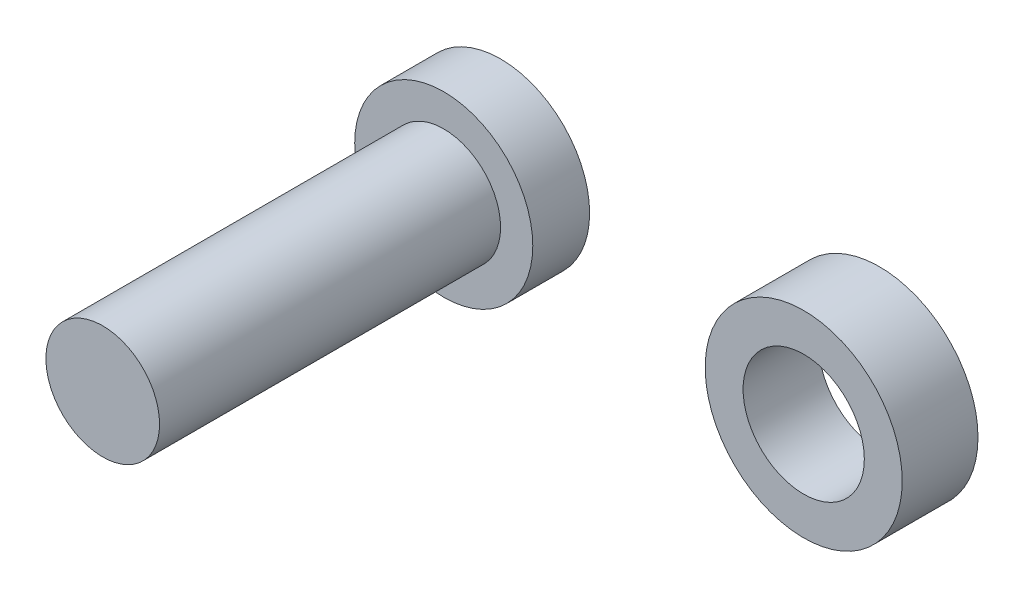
from build123d import *

# Parameters (mm, degrees)
SKIZZE1_R                       = 2.35
AUFSATZ_LINEAR_AUSTRAGEN1_DEPTH = 1.5
SKIZZE2_R                       = 1.5
AUFSATZ_LINEAR_AUSTRAGEN2_DEPTH = 9
SKIZZE3_R                       = 2.6
SKIZZE3_R_2                     = 1.6
AUFSATZ_LINEAR_AUSTRAGEN3_DEPTH = 2


with BuildPart() as part:
    # Skizze1 → Aufsatz-Linear austragen1 (new body)
    with BuildSketch(Plane.XY):
        Circle(SKIZZE1_R)
    extrude(amount=AUFSATZ_LINEAR_AUSTRAGEN1_DEPTH)

    # Skizze2 → Aufsatz-Linear austragen2 (add)
    with BuildSketch(Plane.XY.offset(1.5)):
        Circle(SKIZZE2_R)
    extrude(amount=AUFSATZ_LINEAR_AUSTRAGEN2_DEPTH)


with BuildPart() as body_2:
    # Skizze3 → Aufsatz-Linear austragen3 (new body)
    with BuildSketch(Plane.XY):
        with Locations((10, 0)):
            Circle(SKIZZE3_R)
        with Locations((10, 0)):
            Circle(SKIZZE3_R_2, mode=Mode.SUBTRACT)
    extrude(amount=AUFSATZ_LINEAR_AUSTRAGEN3_DEPTH)


solid = Compound([part.part, body_2.part])
